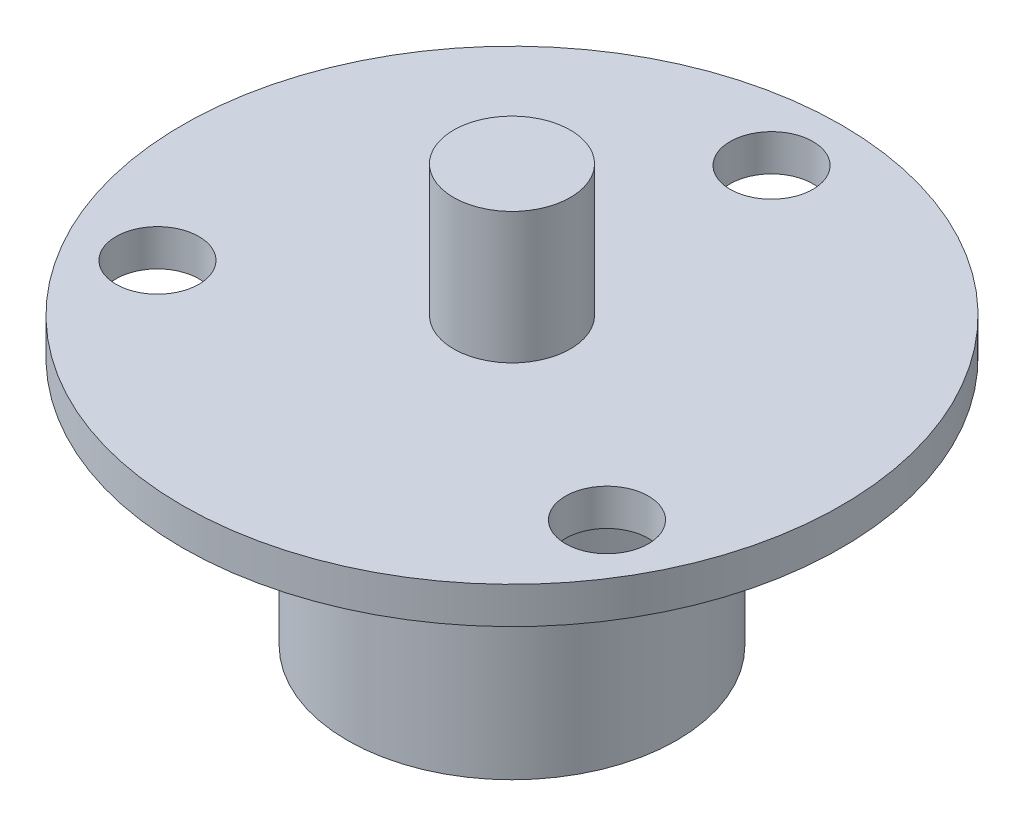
ISO-10303-21;
HEADER;
FILE_DESCRIPTION(('STEP AP214'),'2;1');
FILE_NAME('part.step','',(''),(''),'','','');
FILE_SCHEMA(('AUTOMOTIVE_DESIGN { 1 0 10303 214 1 1 1 1 }'));
ENDSEC;
DATA;
#1=APPLICATION_CONTEXT('core data for automotive mechanical design processes');
#2=APPLICATION_PROTOCOL_DEFINITION('international standard','automotive_design',2000,#1);
#3=PRODUCT_CONTEXT('',#1,'mechanical');
#4=PRODUCT('Part','Part','',(#3));
#5=PRODUCT_RELATED_PRODUCT_CATEGORY('part','',(#4));
#6=PRODUCT_DEFINITION_FORMATION('','',#4);
#7=PRODUCT_DEFINITION_CONTEXT('part definition',#1,'design');
#8=PRODUCT_DEFINITION('design','',#6,#7);
#9=PRODUCT_DEFINITION_SHAPE('','',#8);
#10=(LENGTH_UNIT() NAMED_UNIT(*) SI_UNIT(.MILLI.,.METRE.));
#11=(NAMED_UNIT(*) PLANE_ANGLE_UNIT() SI_UNIT($,.RADIAN.));
#12=(NAMED_UNIT(*) SI_UNIT($,.STERADIAN.) SOLID_ANGLE_UNIT());
#13=UNCERTAINTY_MEASURE_WITH_UNIT(LENGTH_MEASURE(1.E-05),#10,'distance_accuracy_value','');
#14=(GEOMETRIC_REPRESENTATION_CONTEXT(3) GLOBAL_UNCERTAINTY_ASSIGNED_CONTEXT((#13)) GLOBAL_UNIT_ASSIGNED_CONTEXT((#10,
#11,#12)) REPRESENTATION_CONTEXT('',''));
#15=CARTESIAN_POINT('',(0.,0.,0.));
#16=DIRECTION('',(0.,0.,1.));
#17=DIRECTION('',(1.,0.,0.));
#18=AXIS2_PLACEMENT_3D('',#15,#16,#17);
#19=CARTESIAN_POINT('',(0.,16.5862,0.));
#20=DIRECTION('',(0.,-1.,0.));
#21=DIRECTION('',(0.,0.,-1.));
#22=AXIS2_PLACEMENT_3D('',#19,#20,#21);
#23=CYLINDRICAL_SURFACE('',#22,10.9601);
#24=CARTESIAN_POINT('',(0.,16.5862,0.));
#25=DIRECTION('',(0.,1.,0.));
#26=DIRECTION('',(0.,0.,1.));
#27=AXIS2_PLACEMENT_3D('',#24,#25,#26);
#28=CIRCLE('',#27,10.9601);
#29=CARTESIAN_POINT('',(0.,16.5862,10.9601));
#30=VERTEX_POINT('',#29);
#31=EDGE_CURVE('E10',#30,#30,#28,.T.);
#32=ORIENTED_EDGE('',*,*,#31,.F.);
#33=EDGE_LOOP('',(#32));
#34=FACE_BOUND('',#33,.T.);
#35=CARTESIAN_POINT('',(0.,0.,0.));
#36=DIRECTION('',(0.,1.,0.));
#37=DIRECTION('',(0.,0.,1.));
#38=AXIS2_PLACEMENT_3D('',#35,#36,#37);
#39=CIRCLE('',#38,10.9601);
#40=CARTESIAN_POINT('',(0.,0.,10.9601));
#41=VERTEX_POINT('',#40);
#42=EDGE_CURVE('E34',#41,#41,#39,.T.);
#43=ORIENTED_EDGE('',*,*,#42,.T.);
#44=EDGE_LOOP('',(#43));
#45=FACE_BOUND('',#44,.T.);
#46=ADVANCED_FACE('F31',(#34,#45),#23,.T.);
#47=CARTESIAN_POINT('',(0.,0.,0.));
#48=DIRECTION('',(0.,1.,0.));
#49=DIRECTION('',(0.,0.,1.));
#50=AXIS2_PLACEMENT_3D('',#47,#48,#49);
#51=PLANE('',#50);
#52=ORIENTED_EDGE('',*,*,#42,.F.);
#53=EDGE_LOOP('',(#52));
#54=FACE_BOUND('',#53,.T.);
#55=ADVANCED_FACE('F86',(#54),#51,.F.);
#56=CARTESIAN_POINT('',(0.,19.0246,0.));
#57=DIRECTION('',(0.,1.,0.));
#58=DIRECTION('',(0.,0.,1.));
#59=AXIS2_PLACEMENT_3D('',#56,#57,#58);
#60=PLANE('',#59);
#61=CARTESIAN_POINT('',(0.,19.0246,0.));
#62=DIRECTION('',(0.,1.,0.));
#63=DIRECTION('',(0.,0.,1.));
#64=AXIS2_PLACEMENT_3D('',#61,#62,#63);
#65=CIRCLE('',#64,3.8862);
#66=CARTESIAN_POINT('',(0.,19.0246,3.8862));
#67=VERTEX_POINT('',#66);
#68=EDGE_CURVE('E67',#67,#67,#65,.T.);
#69=ORIENTED_EDGE('',*,*,#68,.F.);
#70=EDGE_LOOP('',(#69));
#71=FACE_BOUND('',#70,.T.);
#72=CARTESIAN_POINT('',(14.9579907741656,19.0246,8.63599999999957));
#73=DIRECTION('',(0.,1.,0.));
#74=DIRECTION('',(0.,0.,1.));
#75=AXIS2_PLACEMENT_3D('',#72,#73,#74);
#76=CIRCLE('',#75,2.75590000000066);
#77=CARTESIAN_POINT('',(14.9579907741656,19.0246,11.3919000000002));
#78=VERTEX_POINT('',#77);
#79=EDGE_CURVE('E52',#78,#78,#76,.T.);
#80=ORIENTED_EDGE('',*,*,#79,.F.);
#81=EDGE_LOOP('',(#80));
#82=FACE_BOUND('',#81,.T.);
#83=CARTESIAN_POINT('',(0.,19.0246,0.));
#84=DIRECTION('',(0.,1.,0.));
#85=DIRECTION('',(0.,0.,1.));
#86=AXIS2_PLACEMENT_3D('',#83,#84,#85);
#87=CIRCLE('',#86,21.9329);
#88=CARTESIAN_POINT('',(0.,19.0246,21.9329));
#89=VERTEX_POINT('',#88);
#90=EDGE_CURVE('E41',#89,#89,#87,.T.);
#91=ORIENTED_EDGE('',*,*,#90,.T.);
#92=EDGE_LOOP('',(#91));
#93=FACE_BOUND('',#92,.T.);
#94=CARTESIAN_POINT('',(0.,19.0246,-17.272));
#95=DIRECTION('',(0.,1.,0.));
#96=DIRECTION('',(0.,0.,1.));
#97=AXIS2_PLACEMENT_3D('',#94,#95,#96);
#98=CIRCLE('',#97,2.7559);
#99=CARTESIAN_POINT('',(0.,19.0246,-14.5161));
#100=VERTEX_POINT('',#99);
#101=EDGE_CURVE('E46',#100,#100,#98,.T.);
#102=ORIENTED_EDGE('',*,*,#101,.F.);
#103=EDGE_LOOP('',(#102));
#104=FACE_BOUND('',#103,.T.);
#105=CARTESIAN_POINT('',(-14.9579907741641,19.0246,8.63600000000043));
#106=DIRECTION('',(0.,1.,0.));
#107=DIRECTION('',(0.,0.,1.));
#108=AXIS2_PLACEMENT_3D('',#105,#106,#107);
#109=CIRCLE('',#108,2.75590000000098);
#110=CARTESIAN_POINT('',(-14.9579907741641,19.0246,11.3919000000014));
#111=VERTEX_POINT('',#110);
#112=EDGE_CURVE('E58',#111,#111,#109,.T.);
#113=ORIENTED_EDGE('',*,*,#112,.F.);
#114=EDGE_LOOP('',(#113));
#115=FACE_BOUND('',#114,.T.);
#116=ADVANCED_FACE('F82',(#71,#82,#93,#104,#115),#60,.T.);
#117=CARTESIAN_POINT('',(0.,16.5862,0.));
#118=DIRECTION('',(0.,1.,0.));
#119=DIRECTION('',(0.,0.,1.));
#120=AXIS2_PLACEMENT_3D('',#117,#118,#119);
#121=PLANE('',#120);
#122=ORIENTED_EDGE('',*,*,#31,.T.);
#123=EDGE_LOOP('',(#122));
#124=FACE_BOUND('',#123,.T.);
#125=CARTESIAN_POINT('',(0.,16.5862,0.));
#126=DIRECTION('',(0.,1.,0.));
#127=DIRECTION('',(0.,0.,1.));
#128=AXIS2_PLACEMENT_3D('',#125,#126,#127);
#129=CIRCLE('',#128,21.9329);
#130=CARTESIAN_POINT('',(0.,16.5862,21.9329));
#131=VERTEX_POINT('',#130);
#132=EDGE_CURVE('E43',#131,#131,#129,.T.);
#133=ORIENTED_EDGE('',*,*,#132,.F.);
#134=EDGE_LOOP('',(#133));
#135=FACE_BOUND('',#134,.T.);
#136=CARTESIAN_POINT('',(0.,16.5862,-17.272));
#137=DIRECTION('',(0.,1.,0.));
#138=DIRECTION('',(0.,0.,1.));
#139=AXIS2_PLACEMENT_3D('',#136,#137,#138);
#140=CIRCLE('',#139,2.7559);
#141=CARTESIAN_POINT('',(0.,16.5862,-14.5161));
#142=VERTEX_POINT('',#141);
#143=EDGE_CURVE('E49',#142,#142,#140,.T.);
#144=ORIENTED_EDGE('',*,*,#143,.T.);
#145=EDGE_LOOP('',(#144));
#146=FACE_BOUND('',#145,.T.);
#147=CARTESIAN_POINT('',(14.9579907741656,16.5862,8.63599999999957));
#148=DIRECTION('',(0.,1.,0.));
#149=DIRECTION('',(0.,0.,1.));
#150=AXIS2_PLACEMENT_3D('',#147,#148,#149);
#151=CIRCLE('',#150,2.75590000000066);
#152=CARTESIAN_POINT('',(14.9579907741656,16.5862,11.3919000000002));
#153=VERTEX_POINT('',#152);
#154=EDGE_CURVE('E55',#153,#153,#151,.T.);
#155=ORIENTED_EDGE('',*,*,#154,.T.);
#156=EDGE_LOOP('',(#155));
#157=FACE_BOUND('',#156,.T.);
#158=CARTESIAN_POINT('',(-14.9579907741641,16.5862,8.63600000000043));
#159=DIRECTION('',(0.,1.,0.));
#160=DIRECTION('',(0.,0.,1.));
#161=AXIS2_PLACEMENT_3D('',#158,#159,#160);
#162=CIRCLE('',#161,2.75590000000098);
#163=CARTESIAN_POINT('',(-14.9579907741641,16.5862,11.3919000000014));
#164=VERTEX_POINT('',#163);
#165=EDGE_CURVE('E61',#164,#164,#162,.T.);
#166=ORIENTED_EDGE('',*,*,#165,.T.);
#167=EDGE_LOOP('',(#166));
#168=FACE_BOUND('',#167,.T.);
#169=ADVANCED_FACE('F85',(#124,#135,#146,#157,#168),#121,.F.);
#170=CARTESIAN_POINT('',(0.,19.0246,0.));
#171=DIRECTION('',(0.,-1.,0.));
#172=DIRECTION('',(0.,0.,-1.));
#173=AXIS2_PLACEMENT_3D('',#170,#171,#172);
#174=CYLINDRICAL_SURFACE('',#173,21.9329);
#175=ORIENTED_EDGE('',*,*,#90,.F.);
#176=EDGE_LOOP('',(#175));
#177=FACE_BOUND('',#176,.T.);
#178=ORIENTED_EDGE('',*,*,#132,.T.);
#179=EDGE_LOOP('',(#178));
#180=FACE_BOUND('',#179,.T.);
#181=ADVANCED_FACE('F103',(#177,#180),#174,.T.);
#182=CARTESIAN_POINT('',(0.,19.0246,-17.272));
#183=DIRECTION('',(0.,-1.,0.));
#184=DIRECTION('',(0.,0.,-1.));
#185=AXIS2_PLACEMENT_3D('',#182,#183,#184);
#186=CYLINDRICAL_SURFACE('',#185,2.7559);
#187=ORIENTED_EDGE('',*,*,#101,.T.);
#188=EDGE_LOOP('',(#187));
#189=FACE_BOUND('',#188,.T.);
#190=ORIENTED_EDGE('',*,*,#143,.F.);
#191=EDGE_LOOP('',(#190));
#192=FACE_BOUND('',#191,.T.);
#193=ADVANCED_FACE('F108',(#189,#192),#186,.F.);
#194=CARTESIAN_POINT('',(14.9579907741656,19.0246,8.63599999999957));
#195=DIRECTION('',(0.,-1.,0.));
#196=DIRECTION('',(0.,0.,-1.));
#197=AXIS2_PLACEMENT_3D('',#194,#195,#196);
#198=CYLINDRICAL_SURFACE('',#197,2.75590000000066);
#199=ORIENTED_EDGE('',*,*,#79,.T.);
#200=EDGE_LOOP('',(#199));
#201=FACE_BOUND('',#200,.T.);
#202=ORIENTED_EDGE('',*,*,#154,.F.);
#203=EDGE_LOOP('',(#202));
#204=FACE_BOUND('',#203,.T.);
#205=ADVANCED_FACE('F98',(#201,#204),#198,.F.);
#206=CARTESIAN_POINT('',(-14.9579907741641,19.0246,8.63600000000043));
#207=DIRECTION('',(0.,-1.,0.));
#208=DIRECTION('',(0.,0.,-1.));
#209=AXIS2_PLACEMENT_3D('',#206,#207,#208);
#210=CYLINDRICAL_SURFACE('',#209,2.75590000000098);
#211=ORIENTED_EDGE('',*,*,#112,.T.);
#212=EDGE_LOOP('',(#211));
#213=FACE_BOUND('',#212,.T.);
#214=ORIENTED_EDGE('',*,*,#165,.F.);
#215=EDGE_LOOP('',(#214));
#216=FACE_BOUND('',#215,.T.);
#217=ADVANCED_FACE('F78',(#213,#216),#210,.F.);
#218=CARTESIAN_POINT('',(0.,27.75585,0.));
#219=DIRECTION('',(0.,-1.,0.));
#220=DIRECTION('',(0.,0.,-1.));
#221=AXIS2_PLACEMENT_3D('',#218,#219,#220);
#222=CYLINDRICAL_SURFACE('',#221,3.8862);
#223=CARTESIAN_POINT('',(0.,27.75585,0.));
#224=DIRECTION('',(0.,1.,0.));
#225=DIRECTION('',(0.,0.,1.));
#226=AXIS2_PLACEMENT_3D('',#223,#224,#225);
#227=CIRCLE('',#226,3.8862);
#228=CARTESIAN_POINT('',(0.,27.75585,3.8862));
#229=VERTEX_POINT('',#228);
#230=EDGE_CURVE('E64',#229,#229,#227,.T.);
#231=ORIENTED_EDGE('',*,*,#230,.F.);
#232=EDGE_LOOP('',(#231));
#233=FACE_BOUND('',#232,.T.);
#234=ORIENTED_EDGE('',*,*,#68,.T.);
#235=EDGE_LOOP('',(#234));
#236=FACE_BOUND('',#235,.T.);
#237=ADVANCED_FACE('F75',(#233,#236),#222,.T.);
#238=CARTESIAN_POINT('',(0.,27.75585,0.));
#239=DIRECTION('',(0.,1.,0.));
#240=DIRECTION('',(0.,0.,1.));
#241=AXIS2_PLACEMENT_3D('',#238,#239,#240);
#242=PLANE('',#241);
#243=ORIENTED_EDGE('',*,*,#230,.T.);
#244=EDGE_LOOP('',(#243));
#245=FACE_BOUND('',#244,.T.);
#246=ADVANCED_FACE('F73',(#245),#242,.T.);
#247=CLOSED_SHELL('',(#46,#55,#116,#169,#181,#193,#205,#217,#237,#246));
#248=MANIFOLD_SOLID_BREP('B2',#247);
#249=ADVANCED_BREP_SHAPE_REPRESENTATION('',(#18,#248),#14);
#250=SHAPE_DEFINITION_REPRESENTATION(#9,#249);
ENDSEC;
END-ISO-10303-21;
